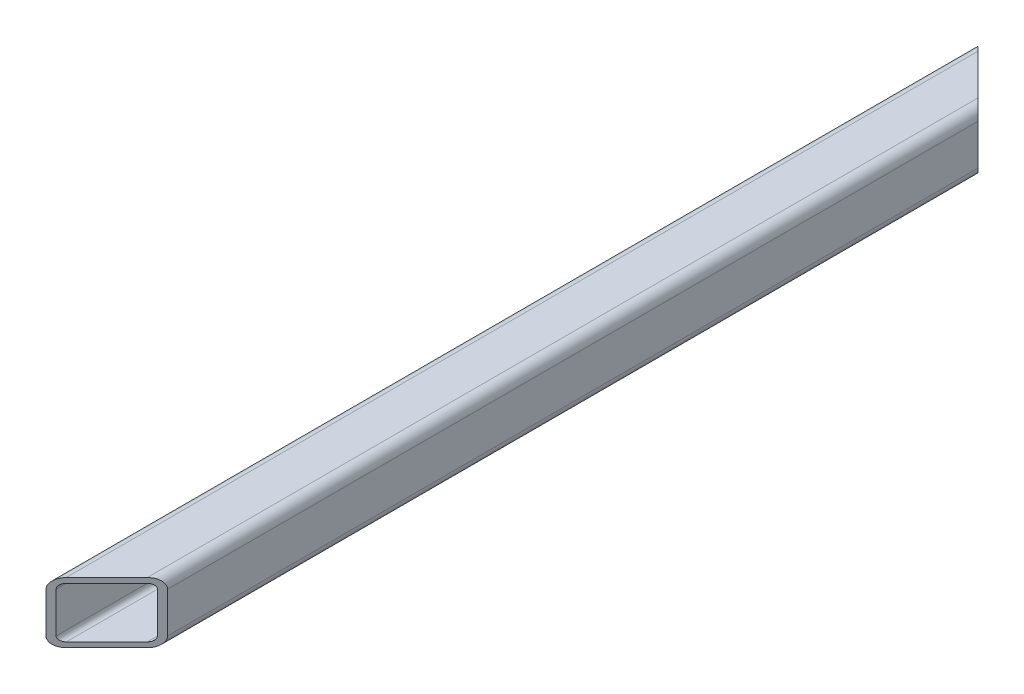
from build123d import *

# Parameters (mm, degrees)
EXTRUSION1_DEPTH = 920
EXTRUSION3_DEPTH = 923.442410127
EXTRUSION4_DEPTH = 923.442410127


with BuildPart() as part:
    # Sketch1 → Extrusion1 (new body)
    with BuildSketch(Plane.XY):
        with BuildLine():
            Line((-20, -30), (20, -30))
            ThreePointArc((20, -30), (27.071067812, -27.071067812), (30, -20))
            Line((30, -20), (30, 20))
            ThreePointArc((30, 20), (27.071067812, 27.071067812), (20, 30))
            Line((20, 30), (-20, 30))
            ThreePointArc((-20, 30), (-27.071067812, 27.071067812), (-30, 20))
            Line((-30, 20), (-30, -20))
            ThreePointArc((-30, -20), (-27.071067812, -27.071067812), (-20, -30))
        make_face()
        with BuildLine():
            Line((-20, -25), (20, -25))
            ThreePointArc((20, -25), (23.535533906, -23.535533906), (25, -20))
            Line((25, -20), (25, 20))
            ThreePointArc((25, 20), (23.535533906, 23.535533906), (20, 25))
            Line((20, 25), (-20, 25))
            ThreePointArc((-20, 25), (-23.535533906, 23.535533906), (-25, 20))
            Line((-25, 20), (-25, -20))
            ThreePointArc((-25, -20), (-23.535533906, -23.535533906), (-20, -25))
        make_face(mode=Mode.SUBTRACT)
    extrude(amount=EXTRUSION1_DEPTH)

    # Esquisse3 → Extrusion3 (cut, through all)
    with BuildSketch(Plane(origin=(0, 30, 0), x_dir=(1, 0, 0), z_dir=(0, 1, 0))):
        Polygon((30, -920), (-30, -920), (30, -860), align=None)
    extrude(amount=-EXTRUSION3_DEPTH, mode=Mode.SUBTRACT)

    # Esquisse4 → Extrusion4 (cut, through all)
    with BuildSketch(Plane(origin=(0, 30, 0), x_dir=(1, 0, 0), z_dir=(0, 1, 0))):
        Polygon((-30, 0), (30, -60), (30, 0), align=None)
    extrude(amount=-EXTRUSION4_DEPTH, mode=Mode.SUBTRACT)


solid = part.part
